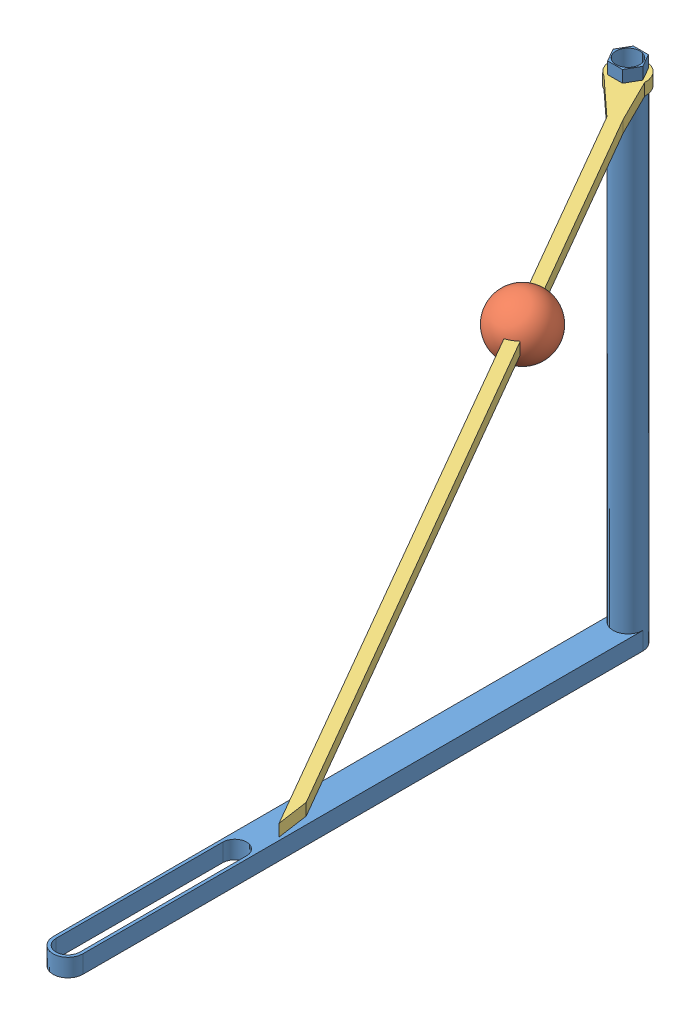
SolidWorks assembly Pointer Assembly Sun.SLDASM, configuration Default (file format 6000). Lengths in mm.
Overall size (43.35 43.5 72.08).
3 component instances, 3 part files, 7 mates.
Components (placement in the parent):
- Rod Sun-1: Rod Sun.SLDPRT [Default] at (-30.7178 -41.4472 6.431) size (2.5 42.5 49.5)
- Orb Sun-1: Orb Sun.SLDPRT [Default] at (-17.2644 -0.4472 28.733) x (-0.866025 0 0.5) z (0.5 0 0.866025) size (5 5 4.9)
- Pointer Sun-1: Pointer Sun.SLDPRT [Default] at (-30.7178 -0.9472 6.431) x (0.5 0 0.866025) z (-0.866025 0 0.5) size (81.5 1 3)
Mates (geometry in assembly coordinates):
- Coincident1: coincident anti-aligned: plane of Rod Sun-1 through (-30.7178 -0.9472 6.431) normal (0 1 0); plane of Pointer Sun-1 through (-30.7178 -0.9472 6.431) normal (0 -1 0)
- Concentric1: concentric aligned: cylinder of Rod Sun-1 through (-30.7178 1.0528 6.431) axis (0 -1 0) radius 1.25; cylinder of Pointer Sun-1 through (-30.7178 0.0528 6.431) axis (0 -1 0) radius 1.5
- Concentric2: concentric aligned: cylinder of Rod Sun-1 through (-30.7178 1.0528 6.431) axis (0 -1 0) radius 1.25; cylinder of Pointer Sun-1 through (-30.7178 0.0528 6.431) axis (0 -1 0) radius 1.5
- Coincident2: coincident anti-aligned: plane of Rod Sun-1 through (-29.7803 -0.9472 5.8898) normal (0.866025 0 -0.5); plane of Pointer Sun-1 through (-29.4678 0.0528 6.431) normal (-0.866025 0 0.5)
- Coincident3: coincident anti-aligned: plane of Orb Sun-1 through (-18.0819 0.0528 26.3171) normal (0 -1 0); plane of Pointer Sun-1 through (-30.7178 0.0528 6.431) normal (0 1 0)
- Coincident4: coincident anti-aligned: plane of Orb Sun-1 through (-18.9479 0.0528 26.8171) normal (0.866025 0 -0.5); plane of Pointer Sun-1 through (-28.3032 0.0528 10.6132) normal (-0.866025 0 0.5)
- Coincident5: coincident: point of Orb Sun-1; point of Pointer Sun-1
